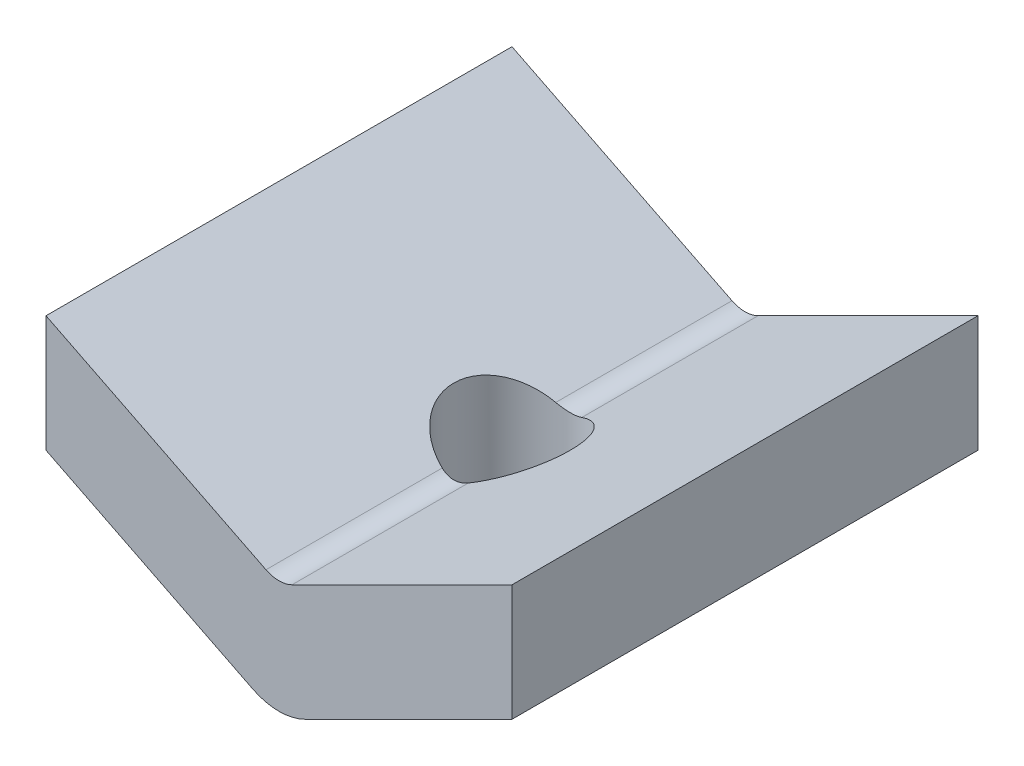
ISO-10303-21;
HEADER;
FILE_DESCRIPTION(('STEP AP214'),'2;1');
FILE_NAME('part.step','',(''),(''),'','','');
FILE_SCHEMA(('AUTOMOTIVE_DESIGN { 1 0 10303 214 1 1 1 1 }'));
ENDSEC;
DATA;
#1=APPLICATION_CONTEXT('core data for automotive mechanical design processes');
#2=APPLICATION_PROTOCOL_DEFINITION('international standard','automotive_design',2000,#1);
#3=PRODUCT_CONTEXT('',#1,'mechanical');
#4=PRODUCT('Part','Part','',(#3));
#5=PRODUCT_RELATED_PRODUCT_CATEGORY('part','',(#4));
#6=PRODUCT_DEFINITION_FORMATION('','',#4);
#7=PRODUCT_DEFINITION_CONTEXT('part definition',#1,'design');
#8=PRODUCT_DEFINITION('design','',#6,#7);
#9=PRODUCT_DEFINITION_SHAPE('','',#8);
#10=(LENGTH_UNIT() NAMED_UNIT(*) SI_UNIT(.MILLI.,.METRE.));
#11=(NAMED_UNIT(*) PLANE_ANGLE_UNIT() SI_UNIT($,.RADIAN.));
#12=(NAMED_UNIT(*) SI_UNIT($,.STERADIAN.) SOLID_ANGLE_UNIT());
#13=UNCERTAINTY_MEASURE_WITH_UNIT(LENGTH_MEASURE(1.E-05),#10,'distance_accuracy_value','');
#14=(GEOMETRIC_REPRESENTATION_CONTEXT(3) GLOBAL_UNCERTAINTY_ASSIGNED_CONTEXT((#13)) GLOBAL_UNIT_ASSIGNED_CONTEXT((#10,
#11,#12)) REPRESENTATION_CONTEXT('',''));
#15=CARTESIAN_POINT('',(0.,0.,0.));
#16=DIRECTION('',(0.,0.,1.));
#17=DIRECTION('',(1.,0.,0.));
#18=AXIS2_PLACEMENT_3D('',#15,#16,#17);
#19=CARTESIAN_POINT('',(0.223606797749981,2.11180339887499,4.));
#20=DIRECTION('',(0.447213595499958,-0.894427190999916,0.));
#21=DIRECTION('',(0.894427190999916,0.447213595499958,0.));
#22=AXIS2_PLACEMENT_3D('',#19,#20,#21);
#23=PLANE('',#22);
#24=CARTESIAN_POINT('',(0.,2.,0.));
#25=DIRECTION('',(0.447213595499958,-0.894427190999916,0.));
#26=DIRECTION('',(-0.894427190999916,-0.447213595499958,0.));
#27=AXIS2_PLACEMENT_3D('',#24,#25,#26);
#28=ELLIPSE('',#27,1.11803398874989,1.);
#29=CARTESIAN_POINT('',(0.223606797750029,2.111803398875,0.9746794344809));
#30=VERTEX_POINT('',#29);
#31=CARTESIAN_POINT('',(0.223606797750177,2.11180339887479,-0.974679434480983));
#32=VERTEX_POINT('',#31);
#33=EDGE_CURVE('E173',#30,#32,#28,.F.);
#34=ORIENTED_EDGE('',*,*,#33,.F.);
#35=DIRECTION('',(0.,0.,-1.));
#36=VECTOR('',#35,1.);
#37=CARTESIAN_POINT('',(0.223606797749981,2.11180339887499,4.));
#38=LINE('',#37,#36);
#39=CARTESIAN_POINT('',(0.223606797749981,2.11180339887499,4.));
#40=VERTEX_POINT('',#39);
#41=EDGE_CURVE('E152',#40,#30,#38,.T.);
#42=ORIENTED_EDGE('',*,*,#41,.F.);
#43=DIRECTION('',(-0.894427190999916,-0.447213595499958,0.));
#44=VECTOR('',#43,1.);
#45=CARTESIAN_POINT('',(0.223606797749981,2.11180339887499,4.));
#46=LINE('',#45,#44);
#47=CARTESIAN_POINT('',(4.,4.,4.));
#48=VERTEX_POINT('',#47);
#49=EDGE_CURVE('E164',#48,#40,#46,.T.);
#50=ORIENTED_EDGE('',*,*,#49,.F.);
#51=DIRECTION('',(0.,0.,-1.));
#52=VECTOR('',#51,1.);
#53=CARTESIAN_POINT('',(4.,4.,4.));
#54=LINE('',#53,#52);
#55=CARTESIAN_POINT('',(4.,4.,-4.));
#56=VERTEX_POINT('',#55);
#57=EDGE_CURVE('E35',#48,#56,#54,.T.);
#58=ORIENTED_EDGE('',*,*,#57,.T.);
#59=DIRECTION('',(-0.894427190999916,-0.447213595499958,0.));
#60=VECTOR('',#59,1.);
#61=CARTESIAN_POINT('',(0.223606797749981,2.11180339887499,-4.));
#62=LINE('',#61,#60);
#63=CARTESIAN_POINT('',(0.223606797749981,2.11180339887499,-4.));
#64=VERTEX_POINT('',#63);
#65=EDGE_CURVE('E161',#56,#64,#62,.T.);
#66=ORIENTED_EDGE('',*,*,#65,.T.);
#67=EDGE_CURVE('E151',#32,#64,#38,.T.);
#68=ORIENTED_EDGE('',*,*,#67,.F.);
#69=EDGE_LOOP('',(#34,#42,#50,#58,#66,#68));
#70=FACE_BOUND('',#69,.T.);
#71=ADVANCED_FACE('F27',(#70),#23,.F.);
#72=CARTESIAN_POINT('',(0.,2.55901699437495,4.));
#73=DIRECTION('',(0.,0.,-1.));
#74=DIRECTION('',(-1.,0.,0.));
#75=AXIS2_PLACEMENT_3D('',#72,#73,#74);
#76=CYLINDRICAL_SURFACE('',#75,0.5);
#77=CARTESIAN_POINT('',(-0.5,2.55901699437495,0.866025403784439));
#78=CARTESIAN_POINT('',(-0.499998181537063,2.53296309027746,0.866027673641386));
#79=CARTESIAN_POINT('',(-0.497949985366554,2.50687628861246,0.867219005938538));
#80=CARTESIAN_POINT('',(-0.489861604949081,2.45550336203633,0.871811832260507));
#81=CARTESIAN_POINT('',(-0.483813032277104,2.43021903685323,0.875217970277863));
#82=CARTESIAN_POINT('',(-0.468049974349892,2.38129116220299,0.883746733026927));
#83=CARTESIAN_POINT('',(-0.458354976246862,2.35763966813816,0.888860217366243));
#84=CARTESIAN_POINT('',(-0.43563376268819,2.31230489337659,0.900213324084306));
#85=CARTESIAN_POINT('',(-0.422607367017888,2.29062171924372,0.906453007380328));
#86=CARTESIAN_POINT('',(-0.392333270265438,2.2478641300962,0.919984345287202));
#87=CARTESIAN_POINT('',(-0.374826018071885,2.22698742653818,0.927320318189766));
#88=CARTESIAN_POINT('',(-0.336626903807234,2.18831280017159,0.94185991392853));
#89=CARTESIAN_POINT('',(-0.315933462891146,2.17051641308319,0.94906346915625));
#90=CARTESIAN_POINT('',(-0.270244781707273,2.13733341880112,0.963107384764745));
#91=CARTESIAN_POINT('',(-0.245053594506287,2.12219011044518,0.969890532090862));
#92=CARTESIAN_POINT('',(-0.192078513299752,2.09644656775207,0.981753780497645));
#93=CARTESIAN_POINT('',(-0.164296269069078,2.08584346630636,0.986834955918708));
#94=CARTESIAN_POINT('',(-0.109022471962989,2.0702646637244,0.994402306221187));
#95=CARTESIAN_POINT('',(-0.0816508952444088,2.06494223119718,0.99704740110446));
#96=CARTESIAN_POINT('',(-0.0262853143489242,2.05893393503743,1.00003791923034));
#97=CARTESIAN_POINT('',(0.00170830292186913,2.05824526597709,1.00038473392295));
#98=CARTESIAN_POINT('',(0.0549162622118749,2.06139033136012,0.998814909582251));
#99=CARTESIAN_POINT('',(0.0801605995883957,2.06483600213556,0.997092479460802));
#100=CARTESIAN_POINT('',(0.129656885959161,2.07545741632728,0.991871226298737));
#101=CARTESIAN_POINT('',(0.153908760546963,2.08263343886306,0.988372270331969));
#102=CARTESIAN_POINT('',(0.201154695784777,2.10055827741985,0.979857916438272));
#103=CARTESIAN_POINT('',(0.224126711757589,2.11135515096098,0.974822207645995));
#104=CARTESIAN_POINT('',(0.267988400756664,2.13614870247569,0.963688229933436));
#105=CARTESIAN_POINT('',(0.288877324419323,2.15014652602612,0.95758958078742));
#106=CARTESIAN_POINT('',(0.330086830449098,2.18246467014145,0.944221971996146));
#107=CARTESIAN_POINT('',(0.35016703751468,2.20106850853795,0.936896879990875));
#108=CARTESIAN_POINT('',(0.38705218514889,2.24131185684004,0.922271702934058));
#109=CARTESIAN_POINT('',(0.403854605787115,2.26295368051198,0.914971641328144));
#110=CARTESIAN_POINT('',(0.434752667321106,2.31034109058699,0.900720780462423));
#111=CARTESIAN_POINT('',(0.448608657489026,2.33626000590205,0.893821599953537));
#112=CARTESIAN_POINT('',(0.471659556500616,2.39048583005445,0.881877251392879));
#113=CARTESIAN_POINT('',(0.480859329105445,2.41879021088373,0.876830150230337));
#114=CARTESIAN_POINT('',(0.493590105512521,2.47462425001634,0.869723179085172));
#115=CARTESIAN_POINT('',(0.497512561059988,2.50203755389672,0.867458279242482));
#116=CARTESIAN_POINT('',(0.500758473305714,2.55721766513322,0.865589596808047));
#117=CARTESIAN_POINT('',(0.500085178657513,2.58498420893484,0.865983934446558));
#118=CARTESIAN_POINT('',(0.494518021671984,2.63684395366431,0.869171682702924));
#119=CARTESIAN_POINT('',(0.490093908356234,2.66100671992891,0.87169793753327));
#120=CARTESIAN_POINT('',(0.477848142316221,2.70820088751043,0.878470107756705));
#121=CARTESIAN_POINT('',(0.470025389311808,2.73123191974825,0.882716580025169));
#122=CARTESIAN_POINT('',(0.450823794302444,2.7767226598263,0.892681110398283));
#123=CARTESIAN_POINT('',(0.439297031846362,2.79910650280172,0.898458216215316));
#124=CARTESIAN_POINT('',(0.413143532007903,2.84175163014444,0.910780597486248));
#125=CARTESIAN_POINT('',(0.398515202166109,2.86201181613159,0.917326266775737));
#126=CARTESIAN_POINT('',(0.364418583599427,2.90250637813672,0.93143999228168));
#127=CARTESIAN_POINT('',(0.344572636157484,2.92241556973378,0.939032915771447));
#128=CARTESIAN_POINT('',(0.301702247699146,2.95872311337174,0.95367117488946));
#129=CARTESIAN_POINT('',(0.278676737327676,2.97512027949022,0.960716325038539));
#130=CARTESIAN_POINT('',(0.229267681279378,3.00430385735,0.973706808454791));
#131=CARTESIAN_POINT('',(0.202811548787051,3.0169835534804,0.979618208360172));
#132=CARTESIAN_POINT('',(0.147761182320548,3.03758594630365,0.989416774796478));
#133=CARTESIAN_POINT('',(0.119168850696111,3.04551282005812,0.993305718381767));
#134=CARTESIAN_POINT('',(0.0634898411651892,3.05570127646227,0.998337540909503));
#135=CARTESIAN_POINT('',(0.0365057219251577,3.05841593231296,0.999699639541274));
#136=CARTESIAN_POINT('',(-0.0175629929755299,3.0594386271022,1.00021065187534));
#137=CARTESIAN_POINT('',(-0.0446475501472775,3.05774820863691,0.999360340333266));
#138=CARTESIAN_POINT('',(-0.096268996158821,3.05030879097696,0.995669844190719));
#139=CARTESIAN_POINT('',(-0.120856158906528,3.04483456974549,0.992964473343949));
#140=CARTESIAN_POINT('',(-0.168722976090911,3.03035349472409,0.985960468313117));
#141=CARTESIAN_POINT('',(-0.192002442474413,3.02134613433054,0.981661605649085));
#142=CARTESIAN_POINT('',(-0.237711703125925,2.99965346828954,0.97162965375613));
#143=CARTESIAN_POINT('',(-0.260062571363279,2.98682733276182,0.965843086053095));
#144=CARTESIAN_POINT('',(-0.30238732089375,2.95803802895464,0.953440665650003));
#145=CARTESIAN_POINT('',(-0.322360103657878,2.94207341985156,0.946824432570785));
#146=CARTESIAN_POINT('',(-0.361457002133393,2.90561842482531,0.932643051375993));
#147=CARTESIAN_POINT('',(-0.380298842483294,2.88483575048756,0.925048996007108));
#148=CARTESIAN_POINT('',(-0.414331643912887,2.84029163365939,0.910315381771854));
#149=CARTESIAN_POINT('',(-0.429519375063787,2.81652758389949,0.903176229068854));
#150=CARTESIAN_POINT('',(-0.456215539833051,2.7656986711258,0.889998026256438));
#151=CARTESIAN_POINT('',(-0.467592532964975,2.73855322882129,0.884000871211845));
#152=CARTESIAN_POINT('',(-0.485439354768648,2.68235079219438,0.87433078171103));
#153=CARTESIAN_POINT('',(-0.491925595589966,2.65330054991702,0.870650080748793));
#154=CARTESIAN_POINT('',(-0.497183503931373,2.61311431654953,0.867646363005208));
#155=CARTESIAN_POINT('',(-0.498238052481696,2.60233304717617,0.867040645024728));
#156=CARTESIAN_POINT('',(-0.499646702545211,2.58070875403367,0.866229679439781));
#157=CARTESIAN_POINT('',(-0.50000075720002,2.56986572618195,0.866024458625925));
#158=CARTESIAN_POINT('',(-0.5,2.55901699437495,0.866025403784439));
#159=B_SPLINE_CURVE_WITH_KNOTS('',3,(#77,#78,#79,#80,#81,#82,#83,#84,#85,#86,#87,#88,#89,#90,
#91,#92,#93,#94,#95,#96,#97,#98,#99,#100,#101,#102,#103,#104,#105,#106,#107,#108,#109,#110,#111,
#112,#113,#114,#115,#116,#117,#118,#119,#120,#121,#122,#123,#124,#125,#126,#127,#128,#129,#130,
#131,#132,#133,#134,#135,#136,#137,#138,#139,#140,#141,#142,#143,#144,#145,#146,#147,#148,#149,
#150,#151,#152,#153,#154,#155,#156,#157,#158),.UNSPECIFIED.,.T.,.F.,(4,2,2,2,2,2,2,2,2,2,2,2,2,
2,2,2,2,2,2,2,2,2,2,2,2,2,2,2,2,2,2,2,2,2,2,2,2,2,2,2,4),(0.,0.0781160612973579,
0.156396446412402,0.234264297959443,0.312136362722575,0.396431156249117,0.480767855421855,
0.570789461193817,0.660754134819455,0.744317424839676,0.8278301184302,0.904080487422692,
0.980336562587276,1.05764767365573,1.13498649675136,1.21963595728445,1.30435024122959,
1.39444420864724,1.48444387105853,1.56731145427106,1.65012046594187,1.72387091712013,
1.79764526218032,1.87483648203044,1.95206743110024,2.03903371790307,2.12602932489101,
2.21532090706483,2.30453389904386,2.38556135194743,2.46656043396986,2.54222212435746,
2.61789466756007,2.69680375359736,2.7757491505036,2.8625512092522,2.94942971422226,
3.03905374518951,3.12837566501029,3.16090067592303,3.19342786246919),.UNSPECIFIED.);
#160=CARTESIAN_POINT('',(-0.223606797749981,2.11180339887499,0.974679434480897));
#161=VERTEX_POINT('',#160);
#162=EDGE_CURVE('E177',#161,#30,#159,.T.);
#163=ORIENTED_EDGE('',*,*,#162,.F.);
#164=DIRECTION('',(0.,0.,-1.));
#165=VECTOR('',#164,1.);
#166=CARTESIAN_POINT('',(-0.223606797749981,2.11180339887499,4.));
#167=LINE('',#166,#165);
#168=CARTESIAN_POINT('',(-0.223606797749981,2.11180339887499,4.));
#169=VERTEX_POINT('',#168);
#170=EDGE_CURVE('E148',#169,#161,#167,.T.);
#171=ORIENTED_EDGE('',*,*,#170,.F.);
#172=CARTESIAN_POINT('',(0.,2.55901699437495,4.));
#173=DIRECTION('',(0.,0.,-1.));
#174=DIRECTION('',(1.,0.,0.));
#175=AXIS2_PLACEMENT_3D('',#172,#173,#174);
#176=CIRCLE('',#175,0.5);
#177=EDGE_CURVE('E198',#40,#169,#176,.T.);
#178=ORIENTED_EDGE('',*,*,#177,.F.);
#179=ORIENTED_EDGE('',*,*,#41,.T.);
#180=EDGE_LOOP('',(#163,#171,#178,#179));
#181=FACE_BOUND('',#180,.T.);
#182=ADVANCED_FACE('F235',(#181),#76,.F.);
#183=CARTESIAN_POINT('',(-0.5,2.55901699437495,-0.866025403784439));
#184=CARTESIAN_POINT('',(-0.499998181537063,2.58507089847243,-0.866027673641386));
#185=CARTESIAN_POINT('',(-0.497949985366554,2.61115770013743,-0.867219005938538));
#186=CARTESIAN_POINT('',(-0.489861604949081,2.66253062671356,-0.871811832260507));
#187=CARTESIAN_POINT('',(-0.483813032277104,2.68781495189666,-0.875217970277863));
#188=CARTESIAN_POINT('',(-0.468049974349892,2.73674282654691,-0.883746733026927));
#189=CARTESIAN_POINT('',(-0.458354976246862,2.76039432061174,-0.888860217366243));
#190=CARTESIAN_POINT('',(-0.43563376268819,2.80572909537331,-0.900213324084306));
#191=CARTESIAN_POINT('',(-0.422607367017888,2.82741226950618,-0.906453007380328));
#192=CARTESIAN_POINT('',(-0.392333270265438,2.8701698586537,-0.919984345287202));
#193=CARTESIAN_POINT('',(-0.374826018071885,2.89104656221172,-0.927320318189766));
#194=CARTESIAN_POINT('',(-0.336626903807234,2.9297211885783,-0.94185991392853));
#195=CARTESIAN_POINT('',(-0.315933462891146,2.94751757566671,-0.94906346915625));
#196=CARTESIAN_POINT('',(-0.270244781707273,2.98070056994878,-0.963107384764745));
#197=CARTESIAN_POINT('',(-0.245053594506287,2.99584387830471,-0.969890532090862));
#198=CARTESIAN_POINT('',(-0.192078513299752,3.02158742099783,-0.981753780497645));
#199=CARTESIAN_POINT('',(-0.164296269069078,3.03219052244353,-0.986834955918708));
#200=CARTESIAN_POINT('',(-0.109022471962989,3.0477693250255,-0.994402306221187));
#201=CARTESIAN_POINT('',(-0.0816508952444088,3.05309175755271,-0.99704740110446));
#202=CARTESIAN_POINT('',(-0.0262853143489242,3.05910005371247,-1.00003791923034));
#203=CARTESIAN_POINT('',(0.00170830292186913,3.0597887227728,-1.00038473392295));
#204=CARTESIAN_POINT('',(0.0549162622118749,3.05664365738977,-0.998814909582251));
#205=CARTESIAN_POINT('',(0.0801605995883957,3.05319798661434,-0.997092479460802));
#206=CARTESIAN_POINT('',(0.129656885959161,3.04257657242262,-0.991871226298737));
#207=CARTESIAN_POINT('',(0.153908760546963,3.03540054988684,-0.988372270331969));
#208=CARTESIAN_POINT('',(0.201154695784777,3.01747571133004,-0.979857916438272));
#209=CARTESIAN_POINT('',(0.224126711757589,3.00667883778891,-0.974822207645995));
#210=CARTESIAN_POINT('',(0.267988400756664,2.9818852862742,-0.963688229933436));
#211=CARTESIAN_POINT('',(0.288877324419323,2.96788746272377,-0.95758958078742));
#212=CARTESIAN_POINT('',(0.330086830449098,2.93556931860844,-0.944221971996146));
#213=CARTESIAN_POINT('',(0.35016703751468,2.91696548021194,-0.936896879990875));
#214=CARTESIAN_POINT('',(0.38705218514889,2.87672213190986,-0.922271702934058));
#215=CARTESIAN_POINT('',(0.403854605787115,2.85508030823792,-0.914971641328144));
#216=CARTESIAN_POINT('',(0.434752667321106,2.8076928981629,-0.900720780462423));
#217=CARTESIAN_POINT('',(0.448608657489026,2.78177398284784,-0.893821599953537));
#218=CARTESIAN_POINT('',(0.471659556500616,2.72754815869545,-0.881877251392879));
#219=CARTESIAN_POINT('',(0.480859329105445,2.69924377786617,-0.876830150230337));
#220=CARTESIAN_POINT('',(0.493590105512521,2.64340973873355,-0.869723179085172));
#221=CARTESIAN_POINT('',(0.497512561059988,2.61599643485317,-0.867458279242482));
#222=CARTESIAN_POINT('',(0.500758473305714,2.56081632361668,-0.865589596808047));
#223=CARTESIAN_POINT('',(0.500085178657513,2.53304977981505,-0.865983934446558));
#224=CARTESIAN_POINT('',(0.494518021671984,2.48119003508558,-0.869171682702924));
#225=CARTESIAN_POINT('',(0.490093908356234,2.45702726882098,-0.87169793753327));
#226=CARTESIAN_POINT('',(0.477848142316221,2.40983310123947,-0.878470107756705));
#227=CARTESIAN_POINT('',(0.470025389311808,2.38680206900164,-0.882716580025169));
#228=CARTESIAN_POINT('',(0.450823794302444,2.3413113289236,-0.892681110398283));
#229=CARTESIAN_POINT('',(0.439297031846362,2.31892748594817,-0.898458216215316));
#230=CARTESIAN_POINT('',(0.413143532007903,2.27628235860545,-0.910780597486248));
#231=CARTESIAN_POINT('',(0.398515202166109,2.25602217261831,-0.917326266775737));
#232=CARTESIAN_POINT('',(0.364418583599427,2.21552761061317,-0.93143999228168));
#233=CARTESIAN_POINT('',(0.344572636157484,2.19561841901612,-0.939032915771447));
#234=CARTESIAN_POINT('',(0.301702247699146,2.15931087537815,-0.95367117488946));
#235=CARTESIAN_POINT('',(0.278676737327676,2.14291370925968,-0.960716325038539));
#236=CARTESIAN_POINT('',(0.229267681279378,2.1137301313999,-0.973706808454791));
#237=CARTESIAN_POINT('',(0.202811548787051,2.1010504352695,-0.979618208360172));
#238=CARTESIAN_POINT('',(0.147761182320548,2.08044804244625,-0.989416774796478));
#239=CARTESIAN_POINT('',(0.119168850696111,2.07252116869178,-0.993305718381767));
#240=CARTESIAN_POINT('',(0.0634898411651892,2.06233271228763,-0.998337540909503));
#241=CARTESIAN_POINT('',(0.0365057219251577,2.05961805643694,-0.999699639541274));
#242=CARTESIAN_POINT('',(-0.0175629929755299,2.0585953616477,-1.00021065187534));
#243=CARTESIAN_POINT('',(-0.0446475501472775,2.06028578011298,-0.999360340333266));
#244=CARTESIAN_POINT('',(-0.096268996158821,2.06772519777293,-0.995669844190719));
#245=CARTESIAN_POINT('',(-0.120856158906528,2.07319941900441,-0.992964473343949));
#246=CARTESIAN_POINT('',(-0.168722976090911,2.08768049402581,-0.985960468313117));
#247=CARTESIAN_POINT('',(-0.192002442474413,2.09668785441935,-0.981661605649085));
#248=CARTESIAN_POINT('',(-0.237711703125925,2.11838052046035,-0.97162965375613));
#249=CARTESIAN_POINT('',(-0.260062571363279,2.13120665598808,-0.965843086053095));
#250=CARTESIAN_POINT('',(-0.30238732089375,2.15999595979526,-0.953440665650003));
#251=CARTESIAN_POINT('',(-0.322360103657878,2.17596056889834,-0.946824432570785));
#252=CARTESIAN_POINT('',(-0.361457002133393,2.21241556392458,-0.932643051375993));
#253=CARTESIAN_POINT('',(-0.380298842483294,2.23319823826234,-0.925048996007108));
#254=CARTESIAN_POINT('',(-0.414331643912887,2.27774235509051,-0.910315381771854));
#255=CARTESIAN_POINT('',(-0.429519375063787,2.3015064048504,-0.903176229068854));
#256=CARTESIAN_POINT('',(-0.456215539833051,2.35233531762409,-0.889998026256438));
#257=CARTESIAN_POINT('',(-0.467592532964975,2.3794807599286,-0.884000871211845));
#258=CARTESIAN_POINT('',(-0.485439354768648,2.43568319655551,-0.87433078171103));
#259=CARTESIAN_POINT('',(-0.491925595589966,2.46473343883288,-0.870650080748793));
#260=CARTESIAN_POINT('',(-0.497183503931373,2.50491967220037,-0.867646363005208));
#261=CARTESIAN_POINT('',(-0.498238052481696,2.51570094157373,-0.867040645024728));
#262=CARTESIAN_POINT('',(-0.499646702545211,2.53732523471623,-0.866229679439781));
#263=CARTESIAN_POINT('',(-0.50000075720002,2.54816826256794,-0.866024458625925));
#264=CARTESIAN_POINT('',(-0.5,2.55901699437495,-0.866025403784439));
#265=B_SPLINE_CURVE_WITH_KNOTS('',3,(#183,#184,#185,#186,#187,#188,#189,#190,#191,#192,#193,
#194,#195,#196,#197,#198,#199,#200,#201,#202,#203,#204,#205,#206,#207,#208,#209,#210,#211,#212,
#213,#214,#215,#216,#217,#218,#219,#220,#221,#222,#223,#224,#225,#226,#227,#228,#229,#230,#231,
#232,#233,#234,#235,#236,#237,#238,#239,#240,#241,#242,#243,#244,#245,#246,#247,#248,#249,#250,
#251,#252,#253,#254,#255,#256,#257,#258,#259,#260,#261,#262,#263,#264),.UNSPECIFIED.,.T.,.F.,(4,
2,2,2,2,2,2,2,2,2,2,2,2,2,2,2,2,2,2,2,2,2,2,2,2,2,2,2,2,2,2,2,2,2,2,2,2,2,2,2,4),(0.,
0.0781160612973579,0.156396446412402,0.234264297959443,0.312136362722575,0.396431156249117,
0.480767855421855,0.570789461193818,0.660754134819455,0.744317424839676,0.8278301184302,
0.904080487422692,0.980336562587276,1.05764767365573,1.13498649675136,1.21963595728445,
1.30435024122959,1.39444420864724,1.48444387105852,1.56731145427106,1.65012046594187,
1.72387091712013,1.79764526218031,1.87483648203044,1.95206743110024,2.03903371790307,
2.12602932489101,2.21532090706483,2.30453389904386,2.38556135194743,2.46656043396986,
2.54222212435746,2.61789466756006,2.69680375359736,2.7757491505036,2.8625512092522,
2.94942971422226,3.03905374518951,3.12837566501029,3.16090067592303,3.19342786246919),.UNSPECIFIED.);
#266=CARTESIAN_POINT('',(-0.223606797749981,2.11180339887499,-0.974679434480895));
#267=VERTEX_POINT('',#266);
#268=EDGE_CURVE('E42',#32,#267,#265,.T.);
#269=ORIENTED_EDGE('',*,*,#268,.F.);
#270=ORIENTED_EDGE('',*,*,#67,.T.);
#271=CARTESIAN_POINT('',(0.,2.55901699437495,-4.));
#272=DIRECTION('',(0.,0.,-1.));
#273=DIRECTION('',(1.,0.,0.));
#274=AXIS2_PLACEMENT_3D('',#271,#272,#273);
#275=CIRCLE('',#274,0.5);
#276=CARTESIAN_POINT('',(-0.223606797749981,2.11180339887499,-4.));
#277=VERTEX_POINT('',#276);
#278=EDGE_CURVE('E175',#64,#277,#275,.T.);
#279=ORIENTED_EDGE('',*,*,#278,.T.);
#280=EDGE_CURVE('E147',#267,#277,#167,.T.);
#281=ORIENTED_EDGE('',*,*,#280,.F.);
#282=EDGE_LOOP('',(#269,#270,#279,#281));
#283=FACE_BOUND('',#282,.T.);
#284=ADVANCED_FACE('F231',(#283),#76,.F.);
#285=CARTESIAN_POINT('',(-0.223606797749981,2.11180339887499,4.));
#286=DIRECTION('',(-0.447213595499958,-0.894427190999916,0.));
#287=DIRECTION('',(0.894427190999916,-0.447213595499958,0.));
#288=AXIS2_PLACEMENT_3D('',#285,#286,#287);
#289=PLANE('',#288);
#290=CARTESIAN_POINT('',(0.,2.,0.));
#291=DIRECTION('',(-0.447213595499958,-0.894427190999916,0.));
#292=DIRECTION('',(0.894427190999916,-0.447213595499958,0.));
#293=AXIS2_PLACEMENT_3D('',#290,#291,#292);
#294=ELLIPSE('',#293,1.11803398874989,1.);
#295=EDGE_CURVE('E229',#267,#161,#294,.F.);
#296=ORIENTED_EDGE('',*,*,#295,.F.);
#297=ORIENTED_EDGE('',*,*,#280,.T.);
#298=DIRECTION('',(-0.894427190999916,0.447213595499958,0.));
#299=VECTOR('',#298,1.);
#300=CARTESIAN_POINT('',(-0.223606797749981,2.11180339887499,-4.));
#301=LINE('',#300,#299);
#302=CARTESIAN_POINT('',(-4.,4.,-4.));
#303=VERTEX_POINT('',#302);
#304=EDGE_CURVE('E183',#277,#303,#301,.T.);
#305=ORIENTED_EDGE('',*,*,#304,.T.);
#306=DIRECTION('',(0.,0.,-1.));
#307=VECTOR('',#306,1.);
#308=CARTESIAN_POINT('',(-4.,4.,4.));
#309=LINE('',#308,#307);
#310=CARTESIAN_POINT('',(-4.,4.,4.));
#311=VERTEX_POINT('',#310);
#312=EDGE_CURVE('E144',#311,#303,#309,.T.);
#313=ORIENTED_EDGE('',*,*,#312,.F.);
#314=DIRECTION('',(-0.894427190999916,0.447213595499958,0.));
#315=VECTOR('',#314,1.);
#316=CARTESIAN_POINT('',(-0.223606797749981,2.11180339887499,4.));
#317=LINE('',#316,#315);
#318=EDGE_CURVE('E200',#169,#311,#317,.T.);
#319=ORIENTED_EDGE('',*,*,#318,.F.);
#320=ORIENTED_EDGE('',*,*,#170,.T.);
#321=EDGE_LOOP('',(#296,#297,#305,#313,#319,#320));
#322=FACE_BOUND('',#321,.T.);
#323=ADVANCED_FACE('F226',(#322),#289,.F.);
#324=CARTESIAN_POINT('',(-0.447213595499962,0.223606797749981,4.));
#325=DIRECTION('',(0.447213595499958,0.894427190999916,0.));
#326=DIRECTION('',(-0.894427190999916,0.447213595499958,0.));
#327=AXIS2_PLACEMENT_3D('',#324,#325,#326);
#328=PLANE('',#327);
#329=CARTESIAN_POINT('',(0.,0.,0.));
#330=DIRECTION('',(0.447213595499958,0.894427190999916,0.));
#331=DIRECTION('',(0.894427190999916,-0.447213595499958,0.));
#332=AXIS2_PLACEMENT_3D('',#329,#330,#331);
#333=ELLIPSE('',#332,1.11803398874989,1.);
#334=CARTESIAN_POINT('',(-0.447213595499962,0.223606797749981,0.894427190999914));
#335=VERTEX_POINT('',#334);
#336=CARTESIAN_POINT('',(-0.447213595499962,0.223606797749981,-0.894427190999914));
#337=VERTEX_POINT('',#336);
#338=EDGE_CURVE('E128',#335,#337,#333,.F.);
#339=ORIENTED_EDGE('',*,*,#338,.F.);
#340=DIRECTION('',(0.,0.,-1.));
#341=VECTOR('',#340,1.);
#342=CARTESIAN_POINT('',(-0.447213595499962,0.223606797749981,4.));
#343=LINE('',#342,#341);
#344=CARTESIAN_POINT('',(-0.447213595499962,0.223606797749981,4.));
#345=VERTEX_POINT('',#344);
#346=EDGE_CURVE('E127',#345,#335,#343,.T.);
#347=ORIENTED_EDGE('',*,*,#346,.F.);
#348=DIRECTION('',(0.894427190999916,-0.447213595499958,0.));
#349=VECTOR('',#348,1.);
#350=CARTESIAN_POINT('',(-0.447213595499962,0.223606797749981,4.));
#351=LINE('',#350,#349);
#352=CARTESIAN_POINT('',(-4.,2.,4.));
#353=VERTEX_POINT('',#352);
#354=EDGE_CURVE('E204',#353,#345,#351,.T.);
#355=ORIENTED_EDGE('',*,*,#354,.F.);
#356=DIRECTION('',(0.,0.,-1.));
#357=VECTOR('',#356,1.);
#358=CARTESIAN_POINT('',(-4.,2.,4.));
#359=LINE('',#358,#357);
#360=CARTESIAN_POINT('',(-4.,2.,-4.));
#361=VERTEX_POINT('',#360);
#362=EDGE_CURVE('E141',#353,#361,#359,.T.);
#363=ORIENTED_EDGE('',*,*,#362,.T.);
#364=DIRECTION('',(0.894427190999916,-0.447213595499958,0.));
#365=VECTOR('',#364,1.);
#366=CARTESIAN_POINT('',(-0.447213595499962,0.223606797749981,-4.));
#367=LINE('',#366,#365);
#368=CARTESIAN_POINT('',(-0.447213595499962,0.223606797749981,-4.));
#369=VERTEX_POINT('',#368);
#370=EDGE_CURVE('E187',#361,#369,#367,.T.);
#371=ORIENTED_EDGE('',*,*,#370,.T.);
#372=EDGE_CURVE('E133',#337,#369,#343,.T.);
#373=ORIENTED_EDGE('',*,*,#372,.F.);
#374=EDGE_LOOP('',(#339,#347,#355,#363,#371,#373));
#375=FACE_BOUND('',#374,.T.);
#376=ADVANCED_FACE('F217',(#375),#328,.F.);
#377=CARTESIAN_POINT('',(0.,1.11803398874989,4.));
#378=DIRECTION('',(0.,0.,-1.));
#379=DIRECTION('',(-1.,0.,0.));
#380=AXIS2_PLACEMENT_3D('',#377,#378,#379);
#381=CYLINDRICAL_SURFACE('',#380,1.);
#382=CARTESIAN_POINT('',(0.,1.11803398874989,0.));
#383=DIRECTION('',(0.,-0.707106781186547,-0.707106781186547));
#384=DIRECTION('',(0.,0.707106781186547,-0.707106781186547));
#385=AXIS2_PLACEMENT_3D('',#382,#383,#384);
#386=ELLIPSE('',#385,1.41421356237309,1.);
#387=CARTESIAN_POINT('',(0.447213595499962,0.223606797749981,0.894427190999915));
#388=VERTEX_POINT('',#387);
#389=EDGE_CURVE('E114',#388,#335,#386,.T.);
#390=ORIENTED_EDGE('',*,*,#389,.F.);
#391=DIRECTION('',(0.,0.,-1.));
#392=VECTOR('',#391,1.);
#393=CARTESIAN_POINT('',(0.447213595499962,0.223606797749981,4.));
#394=LINE('',#393,#392);
#395=CARTESIAN_POINT('',(0.447213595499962,0.223606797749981,4.));
#396=VERTEX_POINT('',#395);
#397=EDGE_CURVE('E124',#396,#388,#394,.T.);
#398=ORIENTED_EDGE('',*,*,#397,.F.);
#399=CARTESIAN_POINT('',(0.,1.11803398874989,4.));
#400=DIRECTION('',(0.,0.,1.));
#401=DIRECTION('',(-1.,0.,0.));
#402=AXIS2_PLACEMENT_3D('',#399,#400,#401);
#403=CIRCLE('',#402,1.);
#404=EDGE_CURVE('E206',#345,#396,#403,.T.);
#405=ORIENTED_EDGE('',*,*,#404,.F.);
#406=ORIENTED_EDGE('',*,*,#346,.T.);
#407=EDGE_LOOP('',(#390,#398,#405,#406));
#408=FACE_BOUND('',#407,.T.);
#409=ADVANCED_FACE('F122',(#408),#381,.T.);
#410=CARTESIAN_POINT('',(0.,1.11803398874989,0.));
#411=DIRECTION('',(0.,0.707106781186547,-0.707106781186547));
#412=DIRECTION('',(0.,-0.707106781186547,-0.707106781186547));
#413=AXIS2_PLACEMENT_3D('',#410,#411,#412);
#414=ELLIPSE('',#413,1.41421356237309,1.);
#415=CARTESIAN_POINT('',(0.447213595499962,0.223606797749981,-0.894427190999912));
#416=VERTEX_POINT('',#415);
#417=EDGE_CURVE('E49',#337,#416,#414,.F.);
#418=ORIENTED_EDGE('',*,*,#417,.F.);
#419=ORIENTED_EDGE('',*,*,#372,.T.);
#420=CARTESIAN_POINT('',(0.,1.11803398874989,-4.));
#421=DIRECTION('',(0.,0.,1.));
#422=DIRECTION('',(-1.,0.,0.));
#423=AXIS2_PLACEMENT_3D('',#420,#421,#422);
#424=CIRCLE('',#423,1.);
#425=CARTESIAN_POINT('',(0.447213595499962,0.223606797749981,-4.));
#426=VERTEX_POINT('',#425);
#427=EDGE_CURVE('E190',#369,#426,#424,.T.);
#428=ORIENTED_EDGE('',*,*,#427,.T.);
#429=EDGE_CURVE('E134',#416,#426,#394,.T.);
#430=ORIENTED_EDGE('',*,*,#429,.F.);
#431=EDGE_LOOP('',(#418,#419,#428,#430));
#432=FACE_BOUND('',#431,.T.);
#433=ADVANCED_FACE('F214',(#432),#381,.T.);
#434=CARTESIAN_POINT('',(0.447213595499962,0.223606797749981,4.));
#435=DIRECTION('',(-0.447213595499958,0.894427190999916,0.));
#436=DIRECTION('',(-0.894427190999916,-0.447213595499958,0.));
#437=AXIS2_PLACEMENT_3D('',#434,#435,#436);
#438=PLANE('',#437);
#439=CARTESIAN_POINT('',(0.,0.,0.));
#440=DIRECTION('',(-0.447213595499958,0.894427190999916,0.));
#441=DIRECTION('',(-0.894427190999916,-0.447213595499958,0.));
#442=AXIS2_PLACEMENT_3D('',#439,#440,#441);
#443=ELLIPSE('',#442,1.11803398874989,1.);
#444=EDGE_CURVE('E11',#416,#388,#443,.F.);
#445=ORIENTED_EDGE('',*,*,#444,.F.);
#446=ORIENTED_EDGE('',*,*,#429,.T.);
#447=DIRECTION('',(0.894427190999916,0.447213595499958,0.));
#448=VECTOR('',#447,1.);
#449=CARTESIAN_POINT('',(0.447213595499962,0.223606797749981,-4.));
#450=LINE('',#449,#448);
#451=CARTESIAN_POINT('',(4.,2.,-4.));
#452=VERTEX_POINT('',#451);
#453=EDGE_CURVE('E193',#426,#452,#450,.T.);
#454=ORIENTED_EDGE('',*,*,#453,.T.);
#455=DIRECTION('',(0.,0.,-1.));
#456=VECTOR('',#455,1.);
#457=CARTESIAN_POINT('',(4.,2.,4.));
#458=LINE('',#457,#456);
#459=CARTESIAN_POINT('',(4.,2.,4.));
#460=VERTEX_POINT('',#459);
#461=EDGE_CURVE('E137',#460,#452,#458,.T.);
#462=ORIENTED_EDGE('',*,*,#461,.F.);
#463=DIRECTION('',(0.894427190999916,0.447213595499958,0.));
#464=VECTOR('',#463,1.);
#465=CARTESIAN_POINT('',(0.447213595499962,0.223606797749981,4.));
#466=LINE('',#465,#464);
#467=EDGE_CURVE('E132',#396,#460,#466,.T.);
#468=ORIENTED_EDGE('',*,*,#467,.F.);
#469=ORIENTED_EDGE('',*,*,#397,.T.);
#470=EDGE_LOOP('',(#445,#446,#454,#462,#468,#469));
#471=FACE_BOUND('',#470,.T.);
#472=ADVANCED_FACE('F130',(#471),#438,.F.);
#473=CARTESIAN_POINT('',(4.,2.,4.));
#474=DIRECTION('',(-1.,0.,0.));
#475=DIRECTION('',(0.,0.,1.));
#476=AXIS2_PLACEMENT_3D('',#473,#474,#475);
#477=PLANE('',#476);
#478=DIRECTION('',(0.,1.,0.));
#479=VECTOR('',#478,1.);
#480=CARTESIAN_POINT('',(4.,2.,-4.));
#481=LINE('',#480,#479);
#482=EDGE_CURVE('E170',#452,#56,#481,.T.);
#483=ORIENTED_EDGE('',*,*,#482,.T.);
#484=ORIENTED_EDGE('',*,*,#57,.F.);
#485=DIRECTION('',(0.,1.,0.));
#486=VECTOR('',#485,1.);
#487=CARTESIAN_POINT('',(4.,2.,4.));
#488=LINE('',#487,#486);
#489=EDGE_CURVE('E195',#460,#48,#488,.T.);
#490=ORIENTED_EDGE('',*,*,#489,.F.);
#491=ORIENTED_EDGE('',*,*,#461,.T.);
#492=EDGE_LOOP('',(#483,#484,#490,#491));
#493=FACE_BOUND('',#492,.T.);
#494=ADVANCED_FACE('F29',(#493),#477,.F.);
#495=CARTESIAN_POINT('',(-4.,2.,4.));
#496=DIRECTION('',(1.,0.,0.));
#497=DIRECTION('',(0.,0.,-1.));
#498=AXIS2_PLACEMENT_3D('',#495,#496,#497);
#499=PLANE('',#498);
#500=DIRECTION('',(0.,-1.,0.));
#501=VECTOR('',#500,1.);
#502=CARTESIAN_POINT('',(-4.,2.,-4.));
#503=LINE('',#502,#501);
#504=EDGE_CURVE('E185',#303,#361,#503,.T.);
#505=ORIENTED_EDGE('',*,*,#504,.T.);
#506=ORIENTED_EDGE('',*,*,#362,.F.);
#507=DIRECTION('',(0.,-1.,0.));
#508=VECTOR('',#507,1.);
#509=CARTESIAN_POINT('',(-4.,2.,4.));
#510=LINE('',#509,#508);
#511=EDGE_CURVE('E202',#311,#353,#510,.T.);
#512=ORIENTED_EDGE('',*,*,#511,.F.);
#513=ORIENTED_EDGE('',*,*,#312,.T.);
#514=EDGE_LOOP('',(#505,#506,#512,#513));
#515=FACE_BOUND('',#514,.T.);
#516=ADVANCED_FACE('F222',(#515),#499,.F.);
#517=CARTESIAN_POINT('',(0.,2.55901699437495,4.));
#518=DIRECTION('',(0.,0.,1.));
#519=DIRECTION('',(1.,0.,0.));
#520=AXIS2_PLACEMENT_3D('',#517,#518,#519);
#521=PLANE('',#520);
#522=ORIENTED_EDGE('',*,*,#489,.T.);
#523=ORIENTED_EDGE('',*,*,#49,.T.);
#524=ORIENTED_EDGE('',*,*,#177,.T.);
#525=ORIENTED_EDGE('',*,*,#318,.T.);
#526=ORIENTED_EDGE('',*,*,#511,.T.);
#527=ORIENTED_EDGE('',*,*,#354,.T.);
#528=ORIENTED_EDGE('',*,*,#404,.T.);
#529=ORIENTED_EDGE('',*,*,#467,.T.);
#530=EDGE_LOOP('',(#522,#523,#524,#525,#526,#527,#528,#529));
#531=FACE_BOUND('',#530,.T.);
#532=ADVANCED_FACE('F208',(#531),#521,.T.);
#533=CARTESIAN_POINT('',(0.,2.55901699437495,-4.));
#534=DIRECTION('',(0.,0.,1.));
#535=DIRECTION('',(1.,0.,0.));
#536=AXIS2_PLACEMENT_3D('',#533,#534,#535);
#537=PLANE('',#536);
#538=ORIENTED_EDGE('',*,*,#482,.F.);
#539=ORIENTED_EDGE('',*,*,#453,.F.);
#540=ORIENTED_EDGE('',*,*,#427,.F.);
#541=ORIENTED_EDGE('',*,*,#370,.F.);
#542=ORIENTED_EDGE('',*,*,#504,.F.);
#543=ORIENTED_EDGE('',*,*,#304,.F.);
#544=ORIENTED_EDGE('',*,*,#278,.F.);
#545=ORIENTED_EDGE('',*,*,#65,.F.);
#546=EDGE_LOOP('',(#538,#539,#540,#541,#542,#543,#544,#545));
#547=FACE_BOUND('',#546,.T.);
#548=ADVANCED_FACE('F210',(#547),#537,.F.);
#549=CARTESIAN_POINT('',(0.,4.,0.));
#550=DIRECTION('',(0.,-1.,0.));
#551=DIRECTION('',(0.,0.,-1.));
#552=AXIS2_PLACEMENT_3D('',#549,#550,#551);
#553=CYLINDRICAL_SURFACE('',#552,1.);
#554=ORIENTED_EDGE('',*,*,#338,.T.);
#555=ORIENTED_EDGE('',*,*,#417,.T.);
#556=ORIENTED_EDGE('',*,*,#444,.T.);
#557=ORIENTED_EDGE('',*,*,#389,.T.);
#558=EDGE_LOOP('',(#554,#555,#556,#557));
#559=FACE_BOUND('',#558,.T.);
#560=ORIENTED_EDGE('',*,*,#33,.T.);
#561=ORIENTED_EDGE('',*,*,#268,.T.);
#562=ORIENTED_EDGE('',*,*,#295,.T.);
#563=ORIENTED_EDGE('',*,*,#162,.T.);
#564=EDGE_LOOP('',(#560,#561,#562,#563));
#565=FACE_BOUND('',#564,.T.);
#566=ADVANCED_FACE('F113',(#559,#565),#553,.F.);
#567=CLOSED_SHELL('',(#71,#182,#284,#323,#376,#409,#433,#472,#494,#516,#532,#548,#566));
#568=MANIFOLD_SOLID_BREP('B2',#567);
#569=ADVANCED_BREP_SHAPE_REPRESENTATION('',(#18,#568),#14);
#570=SHAPE_DEFINITION_REPRESENTATION(#9,#569);
ENDSEC;
END-ISO-10303-21;
